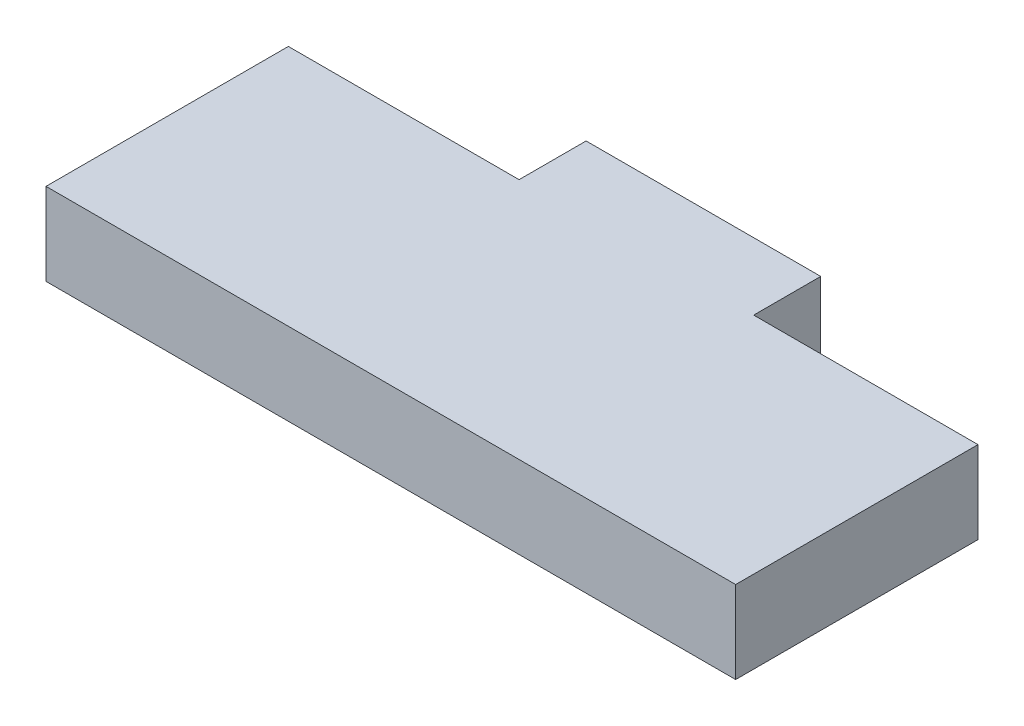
ISO-10303-21;
HEADER;
FILE_DESCRIPTION(('STEP AP214'),'2;1');
FILE_NAME('part.step','',(''),(''),'','','');
FILE_SCHEMA(('AUTOMOTIVE_DESIGN { 1 0 10303 214 1 1 1 1 }'));
ENDSEC;
DATA;
#1=APPLICATION_CONTEXT('core data for automotive mechanical design processes');
#2=APPLICATION_PROTOCOL_DEFINITION('international standard','automotive_design',2000,#1);
#3=PRODUCT_CONTEXT('',#1,'mechanical');
#4=PRODUCT('Part','Part','',(#3));
#5=PRODUCT_RELATED_PRODUCT_CATEGORY('part','',(#4));
#6=PRODUCT_DEFINITION_FORMATION('','',#4);
#7=PRODUCT_DEFINITION_CONTEXT('part definition',#1,'design');
#8=PRODUCT_DEFINITION('design','',#6,#7);
#9=PRODUCT_DEFINITION_SHAPE('','',#8);
#10=(LENGTH_UNIT() NAMED_UNIT(*) SI_UNIT(.MILLI.,.METRE.));
#11=(NAMED_UNIT(*) PLANE_ANGLE_UNIT() SI_UNIT($,.RADIAN.));
#12=(NAMED_UNIT(*) SI_UNIT($,.STERADIAN.) SOLID_ANGLE_UNIT());
#13=UNCERTAINTY_MEASURE_WITH_UNIT(LENGTH_MEASURE(1.E-05),#10,'distance_accuracy_value','');
#14=(GEOMETRIC_REPRESENTATION_CONTEXT(3) GLOBAL_UNCERTAINTY_ASSIGNED_CONTEXT((#13)) GLOBAL_UNIT_ASSIGNED_CONTEXT((#10,
#11,#12)) REPRESENTATION_CONTEXT('',''));
#15=CARTESIAN_POINT('',(0.,0.,0.));
#16=DIRECTION('',(0.,0.,1.));
#17=DIRECTION('',(1.,0.,0.));
#18=AXIS2_PLACEMENT_3D('',#15,#16,#17);
#19=CARTESIAN_POINT('',(-10.021978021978,10.,0.));
#20=DIRECTION('',(1.,0.,0.));
#21=DIRECTION('',(0.,0.,-1.));
#22=AXIS2_PLACEMENT_3D('',#19,#20,#21);
#23=PLANE('',#22);
#24=DIRECTION('',(0.,0.,1.));
#25=VECTOR('',#24,1.);
#26=CARTESIAN_POINT('',(-10.021978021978,0.,0.));
#27=LINE('',#26,#25);
#28=CARTESIAN_POINT('',(-10.021978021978,0.,-8.14285714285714));
#29=VERTEX_POINT('',#28);
#30=CARTESIAN_POINT('',(-10.021978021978,0.,0.));
#31=VERTEX_POINT('',#30);
#32=EDGE_CURVE('E131',#29,#31,#27,.T.);
#33=ORIENTED_EDGE('',*,*,#32,.T.);
#34=DIRECTION('',(0.,-1.,0.));
#35=VECTOR('',#34,1.);
#36=CARTESIAN_POINT('',(-10.021978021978,10.,0.));
#37=LINE('',#36,#35);
#38=CARTESIAN_POINT('',(-10.021978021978,10.,0.));
#39=VERTEX_POINT('',#38);
#40=EDGE_CURVE('E11',#39,#31,#37,.T.);
#41=ORIENTED_EDGE('',*,*,#40,.F.);
#42=DIRECTION('',(0.,0.,1.));
#43=VECTOR('',#42,1.);
#44=CARTESIAN_POINT('',(-10.021978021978,10.,0.));
#45=LINE('',#44,#43);
#46=CARTESIAN_POINT('',(-10.021978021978,10.,-8.14285714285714));
#47=VERTEX_POINT('',#46);
#48=EDGE_CURVE('E145',#47,#39,#45,.T.);
#49=ORIENTED_EDGE('',*,*,#48,.F.);
#50=DIRECTION('',(0.,-1.,0.));
#51=VECTOR('',#50,1.);
#52=CARTESIAN_POINT('',(-10.021978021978,10.,-8.14285714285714));
#53=LINE('',#52,#51);
#54=EDGE_CURVE('E127',#47,#29,#53,.T.);
#55=ORIENTED_EDGE('',*,*,#54,.T.);
#56=EDGE_LOOP('',(#33,#41,#49,#55));
#57=FACE_BOUND('',#56,.T.);
#58=ADVANCED_FACE('F35',(#57),#23,.F.);
#59=CARTESIAN_POINT('',(-38.0521978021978,10.,0.));
#60=DIRECTION('',(0.,0.,1.));
#61=DIRECTION('',(1.,0.,0.));
#62=AXIS2_PLACEMENT_3D('',#59,#60,#61);
#63=PLANE('',#62);
#64=DIRECTION('',(-1.,0.,0.));
#65=VECTOR('',#64,1.);
#66=CARTESIAN_POINT('',(-38.0521978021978,0.,0.));
#67=LINE('',#66,#65);
#68=CARTESIAN_POINT('',(-38.0521978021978,0.,0.));
#69=VERTEX_POINT('',#68);
#70=EDGE_CURVE('E134',#31,#69,#67,.T.);
#71=ORIENTED_EDGE('',*,*,#70,.T.);
#72=DIRECTION('',(0.,-1.,0.));
#73=VECTOR('',#72,1.);
#74=CARTESIAN_POINT('',(-38.0521978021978,10.,0.));
#75=LINE('',#74,#73);
#76=CARTESIAN_POINT('',(-38.0521978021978,10.,0.));
#77=VERTEX_POINT('',#76);
#78=EDGE_CURVE('E43',#77,#69,#75,.T.);
#79=ORIENTED_EDGE('',*,*,#78,.F.);
#80=DIRECTION('',(-1.,0.,0.));
#81=VECTOR('',#80,1.);
#82=CARTESIAN_POINT('',(-38.0521978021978,10.,0.));
#83=LINE('',#82,#81);
#84=EDGE_CURVE('E94',#39,#77,#83,.T.);
#85=ORIENTED_EDGE('',*,*,#84,.F.);
#86=ORIENTED_EDGE('',*,*,#40,.T.);
#87=EDGE_LOOP('',(#71,#79,#85,#86));
#88=FACE_BOUND('',#87,.T.);
#89=ADVANCED_FACE('F180',(#88),#63,.F.);
#90=CARTESIAN_POINT('',(-38.0521978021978,10.,29.4395604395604));
#91=DIRECTION('',(1.,0.,0.));
#92=DIRECTION('',(0.,0.,-1.));
#93=AXIS2_PLACEMENT_3D('',#90,#91,#92);
#94=PLANE('',#93);
#95=DIRECTION('',(0.,0.,1.));
#96=VECTOR('',#95,1.);
#97=CARTESIAN_POINT('',(-38.0521978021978,0.,29.4395604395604));
#98=LINE('',#97,#96);
#99=CARTESIAN_POINT('',(-38.0521978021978,0.,29.4395604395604));
#100=VERTEX_POINT('',#99);
#101=EDGE_CURVE('E136',#69,#100,#98,.T.);
#102=ORIENTED_EDGE('',*,*,#101,.T.);
#103=DIRECTION('',(0.,-1.,0.));
#104=VECTOR('',#103,1.);
#105=CARTESIAN_POINT('',(-38.0521978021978,10.,29.4395604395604));
#106=LINE('',#105,#104);
#107=CARTESIAN_POINT('',(-38.0521978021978,10.,29.4395604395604));
#108=VERTEX_POINT('',#107);
#109=EDGE_CURVE('E152',#108,#100,#106,.T.);
#110=ORIENTED_EDGE('',*,*,#109,.F.);
#111=DIRECTION('',(0.,0.,1.));
#112=VECTOR('',#111,1.);
#113=CARTESIAN_POINT('',(-38.0521978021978,10.,29.4395604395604));
#114=LINE('',#113,#112);
#115=EDGE_CURVE('E160',#77,#108,#114,.T.);
#116=ORIENTED_EDGE('',*,*,#115,.F.);
#117=ORIENTED_EDGE('',*,*,#78,.T.);
#118=EDGE_LOOP('',(#102,#110,#116,#117));
#119=FACE_BOUND('',#118,.T.);
#120=ADVANCED_FACE('F158',(#119),#94,.F.);
#121=CARTESIAN_POINT('',(45.725274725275,10.,29.4395604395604));
#122=DIRECTION('',(0.,0.,-1.));
#123=DIRECTION('',(-1.,0.,0.));
#124=AXIS2_PLACEMENT_3D('',#121,#122,#123);
#125=PLANE('',#124);
#126=DIRECTION('',(1.,0.,0.));
#127=VECTOR('',#126,1.);
#128=CARTESIAN_POINT('',(45.725274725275,0.,29.4395604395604));
#129=LINE('',#128,#127);
#130=CARTESIAN_POINT('',(45.725274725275,0.,29.4395604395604));
#131=VERTEX_POINT('',#130);
#132=EDGE_CURVE('E138',#100,#131,#129,.T.);
#133=ORIENTED_EDGE('',*,*,#132,.T.);
#134=DIRECTION('',(0.,-1.,0.));
#135=VECTOR('',#134,1.);
#136=CARTESIAN_POINT('',(45.725274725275,10.,29.4395604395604));
#137=LINE('',#136,#135);
#138=CARTESIAN_POINT('',(45.725274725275,10.,29.4395604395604));
#139=VERTEX_POINT('',#138);
#140=EDGE_CURVE('E149',#139,#131,#137,.T.);
#141=ORIENTED_EDGE('',*,*,#140,.F.);
#142=DIRECTION('',(1.,0.,0.));
#143=VECTOR('',#142,1.);
#144=CARTESIAN_POINT('',(45.725274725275,10.,29.4395604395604));
#145=LINE('',#144,#143);
#146=EDGE_CURVE('E172',#108,#139,#145,.T.);
#147=ORIENTED_EDGE('',*,*,#146,.F.);
#148=ORIENTED_EDGE('',*,*,#109,.T.);
#149=EDGE_LOOP('',(#133,#141,#147,#148));
#150=FACE_BOUND('',#149,.T.);
#151=ADVANCED_FACE('F168',(#150),#125,.F.);
#152=CARTESIAN_POINT('',(45.7252747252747,10.,0.));
#153=DIRECTION('',(-1.,0.,0.));
#154=DIRECTION('',(0.,0.,1.));
#155=AXIS2_PLACEMENT_3D('',#152,#153,#154);
#156=PLANE('',#155);
#157=DIRECTION('',(0.,0.,-1.));
#158=VECTOR('',#157,1.);
#159=CARTESIAN_POINT('',(45.7252747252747,0.,0.));
#160=LINE('',#159,#158);
#161=CARTESIAN_POINT('',(45.7252747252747,0.,0.));
#162=VERTEX_POINT('',#161);
#163=EDGE_CURVE('E140',#131,#162,#160,.T.);
#164=ORIENTED_EDGE('',*,*,#163,.T.);
#165=DIRECTION('',(0.,-1.,0.));
#166=VECTOR('',#165,1.);
#167=CARTESIAN_POINT('',(45.7252747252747,10.,0.));
#168=LINE('',#167,#166);
#169=CARTESIAN_POINT('',(45.7252747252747,10.,0.));
#170=VERTEX_POINT('',#169);
#171=EDGE_CURVE('E122',#170,#162,#168,.T.);
#172=ORIENTED_EDGE('',*,*,#171,.F.);
#173=DIRECTION('',(0.,0.,-1.));
#174=VECTOR('',#173,1.);
#175=CARTESIAN_POINT('',(45.7252747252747,10.,0.));
#176=LINE('',#175,#174);
#177=EDGE_CURVE('E113',#139,#170,#176,.T.);
#178=ORIENTED_EDGE('',*,*,#177,.F.);
#179=ORIENTED_EDGE('',*,*,#140,.T.);
#180=EDGE_LOOP('',(#164,#172,#178,#179));
#181=FACE_BOUND('',#180,.T.);
#182=ADVANCED_FACE('F171',(#181),#156,.F.);
#183=CARTESIAN_POINT('',(18.478021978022,10.,0.));
#184=DIRECTION('',(0.,0.,1.));
#185=DIRECTION('',(1.,0.,0.));
#186=AXIS2_PLACEMENT_3D('',#183,#184,#185);
#187=PLANE('',#186);
#188=DIRECTION('',(-1.,0.,0.));
#189=VECTOR('',#188,1.);
#190=CARTESIAN_POINT('',(18.478021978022,0.,0.));
#191=LINE('',#190,#189);
#192=CARTESIAN_POINT('',(18.478021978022,0.,0.));
#193=VERTEX_POINT('',#192);
#194=EDGE_CURVE('E121',#162,#193,#191,.T.);
#195=ORIENTED_EDGE('',*,*,#194,.T.);
#196=DIRECTION('',(0.,-1.,0.));
#197=VECTOR('',#196,1.);
#198=CARTESIAN_POINT('',(18.478021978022,10.,0.));
#199=LINE('',#198,#197);
#200=CARTESIAN_POINT('',(18.478021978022,10.,0.));
#201=VERTEX_POINT('',#200);
#202=EDGE_CURVE('E118',#201,#193,#199,.T.);
#203=ORIENTED_EDGE('',*,*,#202,.F.);
#204=DIRECTION('',(-1.,0.,0.));
#205=VECTOR('',#204,1.);
#206=CARTESIAN_POINT('',(18.478021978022,10.,0.));
#207=LINE('',#206,#205);
#208=EDGE_CURVE('E107',#170,#201,#207,.T.);
#209=ORIENTED_EDGE('',*,*,#208,.F.);
#210=ORIENTED_EDGE('',*,*,#171,.T.);
#211=EDGE_LOOP('',(#195,#203,#209,#210));
#212=FACE_BOUND('',#211,.T.);
#213=ADVANCED_FACE('F119',(#212),#187,.F.);
#214=CARTESIAN_POINT('',(18.478021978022,10.,-8.14285714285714));
#215=DIRECTION('',(-1.,0.,0.));
#216=DIRECTION('',(0.,0.,1.));
#217=AXIS2_PLACEMENT_3D('',#214,#215,#216);
#218=PLANE('',#217);
#219=DIRECTION('',(0.,0.,-1.));
#220=VECTOR('',#219,1.);
#221=CARTESIAN_POINT('',(18.478021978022,0.,-8.14285714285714));
#222=LINE('',#221,#220);
#223=CARTESIAN_POINT('',(18.478021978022,0.,-8.14285714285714));
#224=VERTEX_POINT('',#223);
#225=EDGE_CURVE('E80',#193,#224,#222,.T.);
#226=ORIENTED_EDGE('',*,*,#225,.T.);
#227=DIRECTION('',(0.,-1.,0.));
#228=VECTOR('',#227,1.);
#229=CARTESIAN_POINT('',(18.478021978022,10.,-8.14285714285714));
#230=LINE('',#229,#228);
#231=CARTESIAN_POINT('',(18.478021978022,10.,-8.14285714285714));
#232=VERTEX_POINT('',#231);
#233=EDGE_CURVE('E123',#232,#224,#230,.T.);
#234=ORIENTED_EDGE('',*,*,#233,.F.);
#235=DIRECTION('',(0.,0.,-1.));
#236=VECTOR('',#235,1.);
#237=CARTESIAN_POINT('',(18.478021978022,10.,-8.14285714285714));
#238=LINE('',#237,#236);
#239=EDGE_CURVE('E111',#201,#232,#238,.T.);
#240=ORIENTED_EDGE('',*,*,#239,.F.);
#241=ORIENTED_EDGE('',*,*,#202,.T.);
#242=EDGE_LOOP('',(#226,#234,#240,#241));
#243=FACE_BOUND('',#242,.T.);
#244=ADVANCED_FACE('F125',(#243),#218,.F.);
#245=CARTESIAN_POINT('',(-10.021978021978,10.,-8.14285714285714));
#246=DIRECTION('',(0.,0.,1.));
#247=DIRECTION('',(1.,0.,0.));
#248=AXIS2_PLACEMENT_3D('',#245,#246,#247);
#249=PLANE('',#248);
#250=DIRECTION('',(-1.,0.,0.));
#251=VECTOR('',#250,1.);
#252=CARTESIAN_POINT('',(-10.021978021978,0.,-8.14285714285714));
#253=LINE('',#252,#251);
#254=EDGE_CURVE('E86',#224,#29,#253,.T.);
#255=ORIENTED_EDGE('',*,*,#254,.T.);
#256=ORIENTED_EDGE('',*,*,#54,.F.);
#257=DIRECTION('',(-1.,0.,0.));
#258=VECTOR('',#257,1.);
#259=CARTESIAN_POINT('',(-10.021978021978,10.,-8.14285714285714));
#260=LINE('',#259,#258);
#261=EDGE_CURVE('E51',#232,#47,#260,.T.);
#262=ORIENTED_EDGE('',*,*,#261,.F.);
#263=ORIENTED_EDGE('',*,*,#233,.T.);
#264=EDGE_LOOP('',(#255,#256,#262,#263));
#265=FACE_BOUND('',#264,.T.);
#266=ADVANCED_FACE('F196',(#265),#249,.F.);
#267=CARTESIAN_POINT('',(0.,10.,0.));
#268=DIRECTION('',(0.,-1.,0.));
#269=DIRECTION('',(0.,0.,-1.));
#270=AXIS2_PLACEMENT_3D('',#267,#268,#269);
#271=PLANE('',#270);
#272=ORIENTED_EDGE('',*,*,#48,.T.);
#273=ORIENTED_EDGE('',*,*,#84,.T.);
#274=ORIENTED_EDGE('',*,*,#115,.T.);
#275=ORIENTED_EDGE('',*,*,#146,.T.);
#276=ORIENTED_EDGE('',*,*,#177,.T.);
#277=ORIENTED_EDGE('',*,*,#208,.T.);
#278=ORIENTED_EDGE('',*,*,#239,.T.);
#279=ORIENTED_EDGE('',*,*,#261,.T.);
#280=EDGE_LOOP('',(#272,#273,#274,#275,#276,#277,#278,#279));
#281=FACE_BOUND('',#280,.T.);
#282=ADVANCED_FACE('F109',(#281),#271,.F.);
#283=CARTESIAN_POINT('',(0.,0.,0.));
#284=DIRECTION('',(0.,-1.,0.));
#285=DIRECTION('',(0.,0.,-1.));
#286=AXIS2_PLACEMENT_3D('',#283,#284,#285);
#287=PLANE('',#286);
#288=ORIENTED_EDGE('',*,*,#32,.F.);
#289=ORIENTED_EDGE('',*,*,#254,.F.);
#290=ORIENTED_EDGE('',*,*,#225,.F.);
#291=ORIENTED_EDGE('',*,*,#194,.F.);
#292=ORIENTED_EDGE('',*,*,#163,.F.);
#293=ORIENTED_EDGE('',*,*,#132,.F.);
#294=ORIENTED_EDGE('',*,*,#101,.F.);
#295=ORIENTED_EDGE('',*,*,#70,.F.);
#296=EDGE_LOOP('',(#288,#289,#290,#291,#292,#293,#294,#295));
#297=FACE_BOUND('',#296,.T.);
#298=ADVANCED_FACE('F164',(#297),#287,.T.);
#299=CLOSED_SHELL('',(#58,#89,#120,#151,#182,#213,#244,#266,#282,#298));
#300=MANIFOLD_SOLID_BREP('B2',#299);
#301=ADVANCED_BREP_SHAPE_REPRESENTATION('',(#18,#300),#14);
#302=SHAPE_DEFINITION_REPRESENTATION(#9,#301);
ENDSEC;
END-ISO-10303-21;
